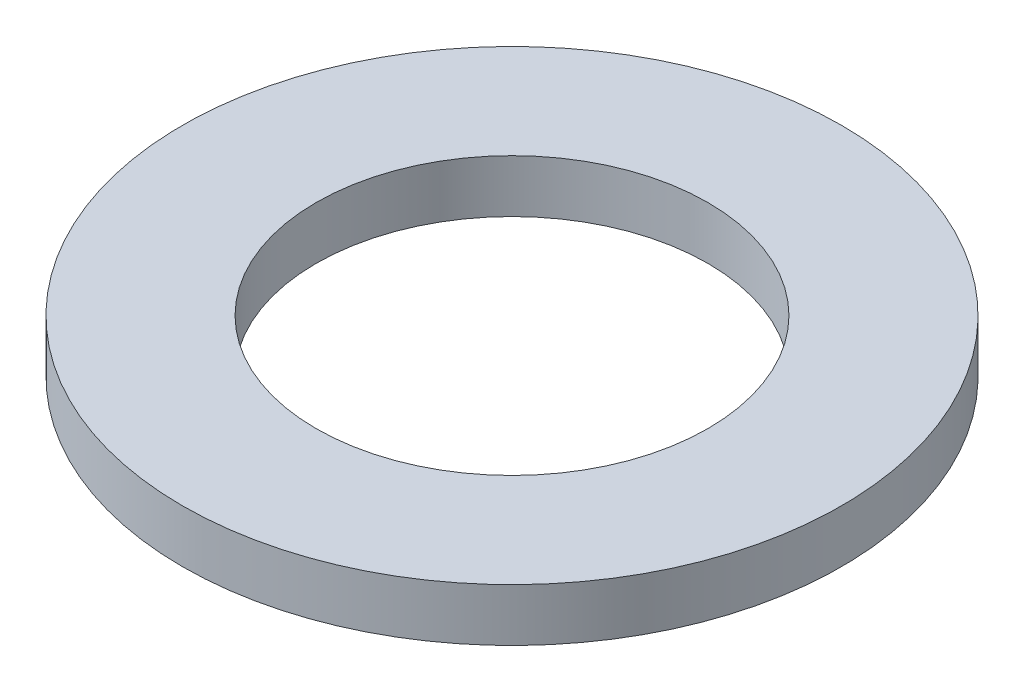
from build123d import *

# Parameters (mm, degrees)
SKETCH1_R      = 87.5
SKETCH1_R_2    = 52
EXTRUDE1_DEPTH = 14


with BuildPart() as part:
    # Sketch1 → Extrude1 (new body)
    with BuildSketch(Plane(origin=(0, 0, 0), x_dir=(1, 0, 0), z_dir=(0, 1, 0))):
        with Locations(Location((0, 0, 0), (0, 0, 270))):
            Circle(SKETCH1_R)
        with Locations(Location((0, 0, 0), (0, 0, 270))):
            Circle(SKETCH1_R_2, mode=Mode.SUBTRACT)
    extrude(amount=EXTRUDE1_DEPTH)


solid = part.part
